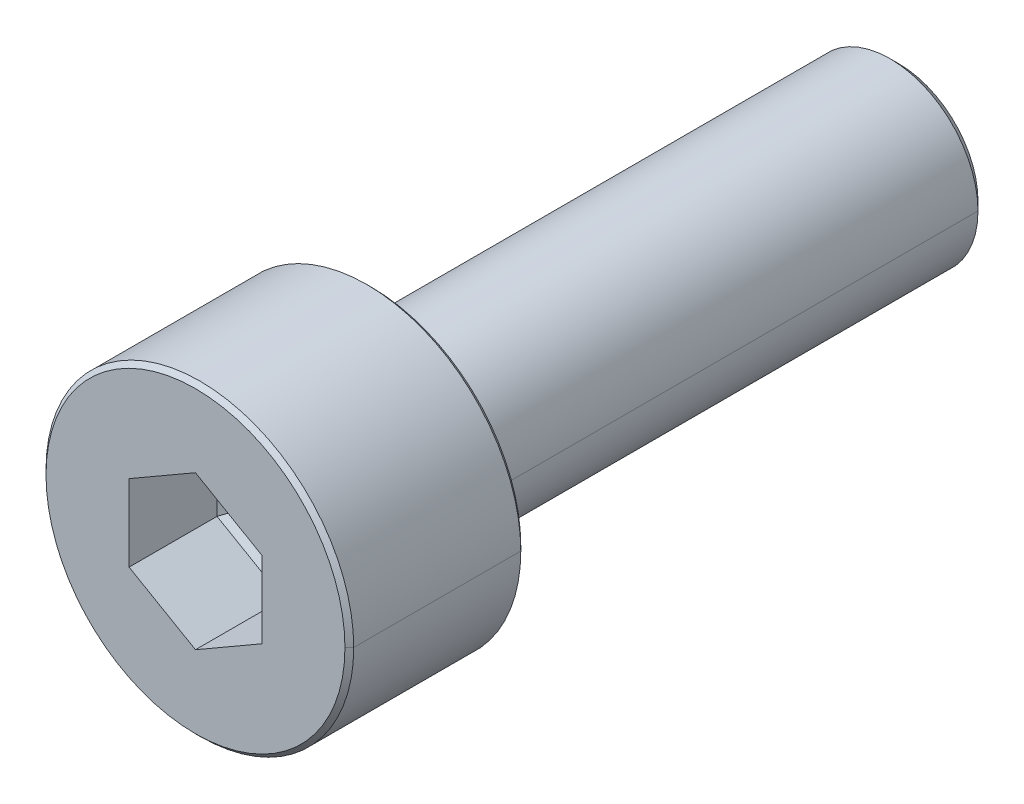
ISO-10303-21;
HEADER;
FILE_DESCRIPTION(('STEP AP214'),'2;1');
FILE_NAME('part.step','',(''),(''),'','','');
FILE_SCHEMA(('AUTOMOTIVE_DESIGN { 1 0 10303 214 1 1 1 1 }'));
ENDSEC;
DATA;
#1=APPLICATION_CONTEXT('core data for automotive mechanical design processes');
#2=APPLICATION_PROTOCOL_DEFINITION('international standard','automotive_design',2000,#1);
#3=PRODUCT_CONTEXT('',#1,'mechanical');
#4=PRODUCT('Part','Part','',(#3));
#5=PRODUCT_RELATED_PRODUCT_CATEGORY('part','',(#4));
#6=PRODUCT_DEFINITION_FORMATION('','',#4);
#7=PRODUCT_DEFINITION_CONTEXT('part definition',#1,'design');
#8=PRODUCT_DEFINITION('design','',#6,#7);
#9=PRODUCT_DEFINITION_SHAPE('','',#8);
#10=(LENGTH_UNIT() NAMED_UNIT(*) SI_UNIT(.MILLI.,.METRE.));
#11=(NAMED_UNIT(*) PLANE_ANGLE_UNIT() SI_UNIT($,.RADIAN.));
#12=(NAMED_UNIT(*) SI_UNIT($,.STERADIAN.) SOLID_ANGLE_UNIT());
#13=UNCERTAINTY_MEASURE_WITH_UNIT(LENGTH_MEASURE(1.E-05),#10,'distance_accuracy_value','');
#14=(GEOMETRIC_REPRESENTATION_CONTEXT(3) GLOBAL_UNCERTAINTY_ASSIGNED_CONTEXT((#13)) GLOBAL_UNIT_ASSIGNED_CONTEXT((#10,
#11,#12)) REPRESENTATION_CONTEXT('',''));
#15=CARTESIAN_POINT('',(0.,0.,0.));
#16=DIRECTION('',(0.,0.,1.));
#17=DIRECTION('',(1.,0.,0.));
#18=AXIS2_PLACEMENT_3D('',#15,#16,#17);
#19=CARTESIAN_POINT('',(0.,0.,12.));
#20=DIRECTION('',(0.,0.,1.));
#21=DIRECTION('',(1.,0.,0.));
#22=AXIS2_PLACEMENT_3D('',#19,#20,#21);
#23=CYLINDRICAL_SURFACE('',#22,3.5);
#24=DIRECTION('',(0.,0.,1.));
#25=VECTOR('',#24,1.);
#26=CARTESIAN_POINT('',(3.500000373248,1.021091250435E-09,12.09999962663));
#27=LINE('',#26,#25);
#28=CARTESIAN_POINT('',(3.5,0.,12.10000099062));
#29=VERTEX_POINT('',#28);
#30=CARTESIAN_POINT('',(3.5,0.,15.89999900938));
#31=VERTEX_POINT('',#30);
#32=EDGE_CURVE('E215',#29,#31,#27,.T.);
#33=ORIENTED_EDGE('',*,*,#32,.F.);
#34=CARTESIAN_POINT('',(0.,0.,12.10000099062));
#35=DIRECTION('',(0.,0.,-1.));
#36=DIRECTION('',(-1.,0.,0.));
#37=AXIS2_PLACEMENT_3D('',#34,#35,#36);
#38=CIRCLE('',#37,3.5);
#39=CARTESIAN_POINT('',(-3.5,0.,12.10000099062));
#40=VERTEX_POINT('',#39);
#41=EDGE_CURVE('E241',#40,#29,#38,.T.);
#42=ORIENTED_EDGE('',*,*,#41,.F.);
#43=DIRECTION('',(0.,0.,1.));
#44=VECTOR('',#43,1.);
#45=CARTESIAN_POINT('',(-3.500000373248,-1.021091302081E-09,12.09999962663));
#46=LINE('',#45,#44);
#47=CARTESIAN_POINT('',(-3.5,0.,15.89999900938));
#48=VERTEX_POINT('',#47);
#49=EDGE_CURVE('E229',#40,#48,#46,.T.);
#50=ORIENTED_EDGE('',*,*,#49,.T.);
#51=CARTESIAN_POINT('',(0.,0.,15.89999900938));
#52=DIRECTION('',(0.,0.,1.));
#53=DIRECTION('',(1.,0.,0.));
#54=AXIS2_PLACEMENT_3D('',#51,#52,#53);
#55=CIRCLE('',#54,3.5);
#56=EDGE_CURVE('E10',#31,#48,#55,.T.);
#57=ORIENTED_EDGE('',*,*,#56,.F.);
#58=EDGE_LOOP('',(#33,#42,#50,#57));
#59=FACE_BOUND('',#58,.T.);
#60=ADVANCED_FACE('F15',(#59),#23,.T.);
#61=CARTESIAN_POINT('',(0.,0.,15.95000061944));
#62=DIRECTION('',(0.,0.,-1.));
#63=DIRECTION('',(0.,-1.,0.));
#64=AXIS2_PLACEMENT_3D('',#61,#62,#63);
#65=CONICAL_SURFACE('',#64,3.450000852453,0.78539837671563);
#66=DIRECTION('',(0.707106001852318,-2.13168504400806E-09,-0.707107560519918));
#67=VECTOR('',#66,1.);
#68=CARTESIAN_POINT('',(3.400000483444,1.322556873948E-09,16.0000004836));
#69=LINE('',#68,#67);
#70=CARTESIAN_POINT('',(3.400000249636,0.,16.00000120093));
#71=VERTEX_POINT('',#70);
#72=EDGE_CURVE('E210',#71,#31,#69,.T.);
#73=ORIENTED_EDGE('',*,*,#72,.T.);
#74=ORIENTED_EDGE('',*,*,#56,.T.);
#75=DIRECTION('',(-0.707106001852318,2.13168543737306E-09,-0.707107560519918));
#76=VECTOR('',#75,1.);
#77=CARTESIAN_POINT('',(-3.400000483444,-1.322555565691E-09,16.0000004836));
#78=LINE('',#77,#76);
#79=CARTESIAN_POINT('',(-3.400000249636,0.,16.00000120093));
#80=VERTEX_POINT('',#79);
#81=EDGE_CURVE('E214',#80,#48,#78,.T.);
#82=ORIENTED_EDGE('',*,*,#81,.F.);
#83=CARTESIAN_POINT('',(0.,0.,16.00000120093));
#84=DIRECTION('',(0.,0.,1.));
#85=DIRECTION('',(1.,0.,0.));
#86=AXIS2_PLACEMENT_3D('',#83,#84,#85);
#87=CIRCLE('',#86,3.400000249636);
#88=EDGE_CURVE('E209',#71,#80,#87,.T.);
#89=ORIENTED_EDGE('',*,*,#88,.F.);
#90=EDGE_LOOP('',(#73,#74,#82,#89));
#91=FACE_BOUND('',#90,.T.);
#92=ADVANCED_FACE('F386',(#91),#65,.T.);
#93=CARTESIAN_POINT('',(0.,0.,13.));
#94=DIRECTION('',(0.,0.,1.));
#95=DIRECTION('',(1.,0.,0.));
#96=AXIS2_PLACEMENT_3D('',#93,#94,#95);
#97=PLANE('',#96);
#98=DIRECTION('',(-0.866025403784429,0.500000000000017,0.));
#99=VECTOR('',#98,1.);
#100=CARTESIAN_POINT('',(0.08660254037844,0.05,13.));
#101=LINE('',#100,#99);
#102=CARTESIAN_POINT('',(0.08660254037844,0.05,13.));
#103=VERTEX_POINT('',#102);
#104=CARTESIAN_POINT('',(0.,0.1,13.));
#105=VERTEX_POINT('',#104);
#106=EDGE_CURVE('E285',#103,#105,#101,.T.);
#107=ORIENTED_EDGE('',*,*,#106,.T.);
#108=DIRECTION('',(-0.866025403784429,-0.500000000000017,0.));
#109=VECTOR('',#108,1.);
#110=CARTESIAN_POINT('',(0.,0.1,13.));
#111=LINE('',#110,#109);
#112=CARTESIAN_POINT('',(-0.08660254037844,0.05,13.));
#113=VERTEX_POINT('',#112);
#114=EDGE_CURVE('E266',#105,#113,#111,.T.);
#115=ORIENTED_EDGE('',*,*,#114,.T.);
#116=DIRECTION('',(0.,-1.,0.));
#117=VECTOR('',#116,1.);
#118=CARTESIAN_POINT('',(-0.08660254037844,0.05,13.));
#119=LINE('',#118,#117);
#120=CARTESIAN_POINT('',(-0.08660254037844,-0.05,13.));
#121=VERTEX_POINT('',#120);
#122=EDGE_CURVE('E40',#113,#121,#119,.T.);
#123=ORIENTED_EDGE('',*,*,#122,.T.);
#124=DIRECTION('',(0.866025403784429,-0.500000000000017,0.));
#125=VECTOR('',#124,1.);
#126=CARTESIAN_POINT('',(-0.08660254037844,-0.05,13.));
#127=LINE('',#126,#125);
#128=CARTESIAN_POINT('',(0.,-0.1,13.));
#129=VERTEX_POINT('',#128);
#130=EDGE_CURVE('E217',#121,#129,#127,.T.);
#131=ORIENTED_EDGE('',*,*,#130,.T.);
#132=DIRECTION('',(0.866025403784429,0.500000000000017,0.));
#133=VECTOR('',#132,1.);
#134=CARTESIAN_POINT('',(0.,-0.1,13.));
#135=LINE('',#134,#133);
#136=CARTESIAN_POINT('',(0.08660254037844,-0.05,13.));
#137=VERTEX_POINT('',#136);
#138=EDGE_CURVE('E204',#129,#137,#135,.T.);
#139=ORIENTED_EDGE('',*,*,#138,.T.);
#140=DIRECTION('',(0.,1.,0.));
#141=VECTOR('',#140,1.);
#142=CARTESIAN_POINT('',(0.08660254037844,-0.05,13.));
#143=LINE('',#142,#141);
#144=EDGE_CURVE('E253',#137,#103,#143,.T.);
#145=ORIENTED_EDGE('',*,*,#144,.T.);
#146=EDGE_LOOP('',(#107,#115,#123,#131,#139,#145));
#147=FACE_BOUND('',#146,.T.);
#148=ADVANCED_FACE('F433',(#147),#97,.T.);
#149=CARTESIAN_POINT('',(-1.51,0.8717989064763,16.));
#150=DIRECTION('',(-1.,0.,0.));
#151=DIRECTION('',(0.,0.,1.));
#152=AXIS2_PLACEMENT_3D('',#149,#150,#151);
#153=PLANE('',#152);
#154=DIRECTION('',(0.,0.,-1.));
#155=VECTOR('',#154,1.);
#156=CARTESIAN_POINT('',(-1.51,0.8717989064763,16.));
#157=LINE('',#156,#155);
#158=CARTESIAN_POINT('',(-1.51,0.8717989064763,16.));
#159=VERTEX_POINT('',#158);
#160=CARTESIAN_POINT('',(-1.51,0.8717989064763,14.));
#161=VERTEX_POINT('',#160);
#162=EDGE_CURVE('E193',#159,#161,#157,.T.);
#163=ORIENTED_EDGE('',*,*,#162,.F.);
#164=DIRECTION('',(0.,-1.,0.));
#165=VECTOR('',#164,1.);
#166=CARTESIAN_POINT('',(-1.51,0.8717989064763,16.));
#167=LINE('',#166,#165);
#168=CARTESIAN_POINT('',(-1.51,-0.8717989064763,16.));
#169=VERTEX_POINT('',#168);
#170=EDGE_CURVE('E228',#159,#169,#167,.T.);
#171=ORIENTED_EDGE('',*,*,#170,.T.);
#172=DIRECTION('',(0.,0.,-1.));
#173=VECTOR('',#172,1.);
#174=CARTESIAN_POINT('',(-1.51,-0.8717989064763,16.));
#175=LINE('',#174,#173);
#176=CARTESIAN_POINT('',(-1.51,-0.8717989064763,14.));
#177=VERTEX_POINT('',#176);
#178=EDGE_CURVE('E300',#169,#177,#175,.T.);
#179=ORIENTED_EDGE('',*,*,#178,.T.);
#180=DIRECTION('',(0.,-1.,0.));
#181=VECTOR('',#180,1.);
#182=CARTESIAN_POINT('',(-1.51,0.8717989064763,14.));
#183=LINE('',#182,#181);
#184=EDGE_CURVE('E26',#161,#177,#183,.T.);
#185=ORIENTED_EDGE('',*,*,#184,.F.);
#186=EDGE_LOOP('',(#163,#171,#179,#185));
#187=FACE_BOUND('',#186,.T.);
#188=ADVANCED_FACE('F350',(#187),#153,.F.);
#189=CARTESIAN_POINT('',(-0.7983012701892,0.,13.5));
#190=DIRECTION('',(-0.574858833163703,0.,-0.818252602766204));
#191=DIRECTION('',(-0.818252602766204,0.,0.574858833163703));
#192=AXIS2_PLACEMENT_3D('',#189,#190,#191);
#193=PLANE('',#192);
#194=DIRECTION('',(-0.73984776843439,-0.427151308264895,0.519775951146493));
#195=VECTOR('',#194,1.);
#196=CARTESIAN_POINT('',(-0.08660254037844,-0.05,13.));
#197=LINE('',#196,#195);
#198=EDGE_CURVE('E220',#121,#177,#197,.T.);
#199=ORIENTED_EDGE('',*,*,#198,.F.);
#200=ORIENTED_EDGE('',*,*,#122,.F.);
#201=DIRECTION('',(-0.73984776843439,0.427151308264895,0.519775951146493));
#202=VECTOR('',#201,1.);
#203=CARTESIAN_POINT('',(-0.08660254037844,0.05,13.));
#204=LINE('',#203,#202);
#205=EDGE_CURVE('E262',#113,#161,#204,.T.);
#206=ORIENTED_EDGE('',*,*,#205,.T.);
#207=ORIENTED_EDGE('',*,*,#184,.T.);
#208=EDGE_LOOP('',(#199,#200,#206,#207));
#209=FACE_BOUND('',#208,.T.);
#210=ADVANCED_FACE('F17',(#209),#193,.F.);
#211=CARTESIAN_POINT('',(-0.3991506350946,-0.6913491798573,13.5));
#212=DIRECTION('',(-0.287429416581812,-0.49784235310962,-0.818252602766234));
#213=DIRECTION('',(0.,-0.854302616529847,0.519775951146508));
#214=AXIS2_PLACEMENT_3D('',#211,#212,#213);
#215=PLANE('',#214);
#216=DIRECTION('',(0.,-0.854302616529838,0.519775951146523));
#217=VECTOR('',#216,1.);
#218=CARTESIAN_POINT('',(0.,-0.1,13.));
#219=LINE('',#218,#217);
#220=CARTESIAN_POINT('',(0.,-1.743597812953,14.));
#221=VERTEX_POINT('',#220);
#222=EDGE_CURVE('E199',#129,#221,#219,.T.);
#223=ORIENTED_EDGE('',*,*,#222,.F.);
#224=ORIENTED_EDGE('',*,*,#130,.F.);
#225=ORIENTED_EDGE('',*,*,#198,.T.);
#226=DIRECTION('',(0.866025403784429,-0.500000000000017,0.));
#227=VECTOR('',#226,1.);
#228=CARTESIAN_POINT('',(-1.51,-0.8717989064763,14.));
#229=LINE('',#228,#227);
#230=EDGE_CURVE('E221',#177,#221,#229,.T.);
#231=ORIENTED_EDGE('',*,*,#230,.T.);
#232=EDGE_LOOP('',(#223,#224,#225,#231));
#233=FACE_BOUND('',#232,.T.);
#234=ADVANCED_FACE('F501',(#233),#215,.F.);
#235=CARTESIAN_POINT('',(-1.51,-0.8717989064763,16.));
#236=DIRECTION('',(-0.500000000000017,-0.866025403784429,0.));
#237=DIRECTION('',(-0.866025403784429,0.500000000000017,0.));
#238=AXIS2_PLACEMENT_3D('',#235,#236,#237);
#239=PLANE('',#238);
#240=ORIENTED_EDGE('',*,*,#178,.F.);
#241=DIRECTION('',(0.866025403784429,-0.500000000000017,0.));
#242=VECTOR('',#241,1.);
#243=CARTESIAN_POINT('',(-1.51,-0.8717989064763,16.));
#244=LINE('',#243,#242);
#245=CARTESIAN_POINT('',(0.,-1.743597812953,16.));
#246=VERTEX_POINT('',#245);
#247=EDGE_CURVE('E191',#169,#246,#244,.T.);
#248=ORIENTED_EDGE('',*,*,#247,.T.);
#249=DIRECTION('',(0.,0.,-1.));
#250=VECTOR('',#249,1.);
#251=CARTESIAN_POINT('',(0.,-1.743597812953,16.));
#252=LINE('',#251,#250);
#253=EDGE_CURVE('E301',#246,#221,#252,.T.);
#254=ORIENTED_EDGE('',*,*,#253,.T.);
#255=ORIENTED_EDGE('',*,*,#230,.F.);
#256=EDGE_LOOP('',(#240,#248,#254,#255));
#257=FACE_BOUND('',#256,.T.);
#258=ADVANCED_FACE('F360',(#257),#239,.F.);
#259=CARTESIAN_POINT('',(0.,-1.743597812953,16.));
#260=DIRECTION('',(0.500000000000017,-0.866025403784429,0.));
#261=DIRECTION('',(0.,0.,-1.));
#262=AXIS2_PLACEMENT_3D('',#259,#260,#261);
#263=PLANE('',#262);
#264=ORIENTED_EDGE('',*,*,#253,.F.);
#265=DIRECTION('',(0.866025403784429,0.500000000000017,0.));
#266=VECTOR('',#265,1.);
#267=CARTESIAN_POINT('',(0.,-1.743597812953,16.));
#268=LINE('',#267,#266);
#269=CARTESIAN_POINT('',(1.51,-0.8717989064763,16.));
#270=VERTEX_POINT('',#269);
#271=EDGE_CURVE('E188',#246,#270,#268,.T.);
#272=ORIENTED_EDGE('',*,*,#271,.T.);
#273=DIRECTION('',(0.,0.,-1.));
#274=VECTOR('',#273,1.);
#275=CARTESIAN_POINT('',(1.51,-0.8717989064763,16.));
#276=LINE('',#275,#274);
#277=CARTESIAN_POINT('',(1.51,-0.8717989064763,14.));
#278=VERTEX_POINT('',#277);
#279=EDGE_CURVE('E247',#270,#278,#276,.T.);
#280=ORIENTED_EDGE('',*,*,#279,.T.);
#281=DIRECTION('',(0.866025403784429,0.500000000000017,0.));
#282=VECTOR('',#281,1.);
#283=CARTESIAN_POINT('',(0.,-1.743597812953,14.));
#284=LINE('',#283,#282);
#285=EDGE_CURVE('E203',#221,#278,#284,.T.);
#286=ORIENTED_EDGE('',*,*,#285,.F.);
#287=EDGE_LOOP('',(#264,#272,#280,#286));
#288=FACE_BOUND('',#287,.T.);
#289=ADVANCED_FACE('F439',(#288),#263,.F.);
#290=CARTESIAN_POINT('',(0.3991506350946,-0.6913491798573,13.5));
#291=DIRECTION('',(0.287429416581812,-0.49784235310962,-0.818252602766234));
#292=DIRECTION('',(0.,-0.854302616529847,0.519775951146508));
#293=AXIS2_PLACEMENT_3D('',#290,#291,#292);
#294=PLANE('',#293);
#295=DIRECTION('',(0.73984776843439,-0.427151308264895,0.519775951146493));
#296=VECTOR('',#295,1.);
#297=CARTESIAN_POINT('',(0.08660254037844,-0.05,13.));
#298=LINE('',#297,#296);
#299=EDGE_CURVE('E236',#137,#278,#298,.T.);
#300=ORIENTED_EDGE('',*,*,#299,.F.);
#301=ORIENTED_EDGE('',*,*,#138,.F.);
#302=ORIENTED_EDGE('',*,*,#222,.T.);
#303=ORIENTED_EDGE('',*,*,#285,.T.);
#304=EDGE_LOOP('',(#300,#301,#302,#303));
#305=FACE_BOUND('',#304,.T.);
#306=ADVANCED_FACE('F442',(#305),#294,.F.);
#307=CARTESIAN_POINT('',(0.7983012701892,0.,13.5));
#308=DIRECTION('',(0.574858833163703,0.,-0.818252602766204));
#309=DIRECTION('',(0.,-1.,0.));
#310=AXIS2_PLACEMENT_3D('',#307,#308,#309);
#311=PLANE('',#310);
#312=DIRECTION('',(0.73984776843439,0.427151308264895,0.519775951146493));
#313=VECTOR('',#312,1.);
#314=CARTESIAN_POINT('',(0.08660254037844,0.05,13.));
#315=LINE('',#314,#313);
#316=CARTESIAN_POINT('',(1.51,0.8717989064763,14.));
#317=VERTEX_POINT('',#316);
#318=EDGE_CURVE('E295',#103,#317,#315,.T.);
#319=ORIENTED_EDGE('',*,*,#318,.F.);
#320=ORIENTED_EDGE('',*,*,#144,.F.);
#321=ORIENTED_EDGE('',*,*,#299,.T.);
#322=DIRECTION('',(0.,1.,0.));
#323=VECTOR('',#322,1.);
#324=CARTESIAN_POINT('',(1.51,-0.8717989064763,14.));
#325=LINE('',#324,#323);
#326=EDGE_CURVE('E256',#278,#317,#325,.T.);
#327=ORIENTED_EDGE('',*,*,#326,.T.);
#328=EDGE_LOOP('',(#319,#320,#321,#327));
#329=FACE_BOUND('',#328,.T.);
#330=ADVANCED_FACE('F447',(#329),#311,.F.);
#331=CARTESIAN_POINT('',(1.51,-0.8717989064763,16.));
#332=DIRECTION('',(1.,0.,0.));
#333=DIRECTION('',(0.,1.,0.));
#334=AXIS2_PLACEMENT_3D('',#331,#332,#333);
#335=PLANE('',#334);
#336=ORIENTED_EDGE('',*,*,#279,.F.);
#337=DIRECTION('',(0.,1.,0.));
#338=VECTOR('',#337,1.);
#339=CARTESIAN_POINT('',(1.51,-0.8717989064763,16.));
#340=LINE('',#339,#338);
#341=CARTESIAN_POINT('',(1.51,0.8717989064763,16.));
#342=VERTEX_POINT('',#341);
#343=EDGE_CURVE('E192',#270,#342,#340,.T.);
#344=ORIENTED_EDGE('',*,*,#343,.T.);
#345=DIRECTION('',(0.,0.,-1.));
#346=VECTOR('',#345,1.);
#347=CARTESIAN_POINT('',(1.51,0.8717989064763,16.));
#348=LINE('',#347,#346);
#349=EDGE_CURVE('E244',#342,#317,#348,.T.);
#350=ORIENTED_EDGE('',*,*,#349,.T.);
#351=ORIENTED_EDGE('',*,*,#326,.F.);
#352=EDGE_LOOP('',(#336,#344,#350,#351));
#353=FACE_BOUND('',#352,.T.);
#354=ADVANCED_FACE('F452',(#353),#335,.F.);
#355=CARTESIAN_POINT('',(1.51,0.8717989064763,16.));
#356=DIRECTION('',(0.500000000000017,0.866025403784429,0.));
#357=DIRECTION('',(0.,0.,-1.));
#358=AXIS2_PLACEMENT_3D('',#355,#356,#357);
#359=PLANE('',#358);
#360=ORIENTED_EDGE('',*,*,#349,.F.);
#361=DIRECTION('',(-0.866025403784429,0.500000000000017,0.));
#362=VECTOR('',#361,1.);
#363=CARTESIAN_POINT('',(1.51,0.8717989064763,16.));
#364=LINE('',#363,#362);
#365=CARTESIAN_POINT('',(0.,1.743597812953,16.));
#366=VERTEX_POINT('',#365);
#367=EDGE_CURVE('E270',#342,#366,#364,.T.);
#368=ORIENTED_EDGE('',*,*,#367,.T.);
#369=DIRECTION('',(0.,0.,-1.));
#370=VECTOR('',#369,1.);
#371=CARTESIAN_POINT('',(0.,1.743597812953,16.));
#372=LINE('',#371,#370);
#373=CARTESIAN_POINT('',(0.,1.743597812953,14.));
#374=VERTEX_POINT('',#373);
#375=EDGE_CURVE('E198',#366,#374,#372,.T.);
#376=ORIENTED_EDGE('',*,*,#375,.T.);
#377=DIRECTION('',(-0.866025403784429,0.500000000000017,0.));
#378=VECTOR('',#377,1.);
#379=CARTESIAN_POINT('',(1.51,0.8717989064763,14.));
#380=LINE('',#379,#378);
#381=EDGE_CURVE('E248',#317,#374,#380,.T.);
#382=ORIENTED_EDGE('',*,*,#381,.F.);
#383=EDGE_LOOP('',(#360,#368,#376,#382));
#384=FACE_BOUND('',#383,.T.);
#385=ADVANCED_FACE('F448',(#384),#359,.F.);
#386=CARTESIAN_POINT('',(0.3991506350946,0.6913491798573,13.5));
#387=DIRECTION('',(0.287429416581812,0.49784235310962,-0.818252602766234));
#388=DIRECTION('',(-0.943483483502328,0.,-0.331419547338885));
#389=AXIS2_PLACEMENT_3D('',#386,#387,#388);
#390=PLANE('',#389);
#391=DIRECTION('',(0.,0.854302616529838,0.519775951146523));
#392=VECTOR('',#391,1.);
#393=CARTESIAN_POINT('',(0.,0.1,13.));
#394=LINE('',#393,#392);
#395=EDGE_CURVE('E281',#105,#374,#394,.T.);
#396=ORIENTED_EDGE('',*,*,#395,.F.);
#397=ORIENTED_EDGE('',*,*,#106,.F.);
#398=ORIENTED_EDGE('',*,*,#318,.T.);
#399=ORIENTED_EDGE('',*,*,#381,.T.);
#400=EDGE_LOOP('',(#396,#397,#398,#399));
#401=FACE_BOUND('',#400,.T.);
#402=ADVANCED_FACE('F451',(#401),#390,.F.);
#403=CARTESIAN_POINT('',(-0.3991506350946,0.6913491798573,13.5));
#404=DIRECTION('',(-0.287429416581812,0.49784235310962,-0.818252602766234));
#405=DIRECTION('',(-0.943483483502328,0.,0.331419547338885));
#406=AXIS2_PLACEMENT_3D('',#403,#404,#405);
#407=PLANE('',#406);
#408=ORIENTED_EDGE('',*,*,#205,.F.);
#409=ORIENTED_EDGE('',*,*,#114,.F.);
#410=ORIENTED_EDGE('',*,*,#395,.T.);
#411=DIRECTION('',(-0.866025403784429,-0.500000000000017,0.));
#412=VECTOR('',#411,1.);
#413=CARTESIAN_POINT('',(0.,1.743597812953,14.));
#414=LINE('',#413,#412);
#415=EDGE_CURVE('E197',#374,#161,#414,.T.);
#416=ORIENTED_EDGE('',*,*,#415,.T.);
#417=EDGE_LOOP('',(#408,#409,#410,#416));
#418=FACE_BOUND('',#417,.T.);
#419=ADVANCED_FACE('F456',(#418),#407,.F.);
#420=CARTESIAN_POINT('',(0.,1.743597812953,16.));
#421=DIRECTION('',(-0.500000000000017,0.866025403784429,0.));
#422=DIRECTION('',(0.,0.,1.));
#423=AXIS2_PLACEMENT_3D('',#420,#421,#422);
#424=PLANE('',#423);
#425=ORIENTED_EDGE('',*,*,#375,.F.);
#426=DIRECTION('',(-0.866025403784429,-0.500000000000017,0.));
#427=VECTOR('',#426,1.);
#428=CARTESIAN_POINT('',(0.,1.743597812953,16.));
#429=LINE('',#428,#427);
#430=EDGE_CURVE('E277',#366,#159,#429,.T.);
#431=ORIENTED_EDGE('',*,*,#430,.T.);
#432=ORIENTED_EDGE('',*,*,#162,.T.);
#433=ORIENTED_EDGE('',*,*,#415,.F.);
#434=EDGE_LOOP('',(#425,#431,#432,#433));
#435=FACE_BOUND('',#434,.T.);
#436=ADVANCED_FACE('F437',(#435),#424,.F.);
#437=CARTESIAN_POINT('',(0.,0.,16.));
#438=DIRECTION('',(0.,0.,1.));
#439=DIRECTION('',(1.,0.,0.));
#440=AXIS2_PLACEMENT_3D('',#437,#438,#439);
#441=PLANE('',#440);
#442=ORIENTED_EDGE('',*,*,#367,.F.);
#443=ORIENTED_EDGE('',*,*,#343,.F.);
#444=ORIENTED_EDGE('',*,*,#271,.F.);
#445=ORIENTED_EDGE('',*,*,#247,.F.);
#446=ORIENTED_EDGE('',*,*,#170,.F.);
#447=ORIENTED_EDGE('',*,*,#430,.F.);
#448=EDGE_LOOP('',(#442,#443,#444,#445,#446,#447));
#449=FACE_BOUND('',#448,.T.);
#450=CARTESIAN_POINT('',(0.,0.,16.00000120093));
#451=DIRECTION('',(0.,0.,1.));
#452=DIRECTION('',(-1.,0.,0.));
#453=AXIS2_PLACEMENT_3D('',#450,#451,#452);
#454=CIRCLE('',#453,3.400000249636);
#455=EDGE_CURVE('E205',#80,#71,#454,.T.);
#456=ORIENTED_EDGE('',*,*,#455,.T.);
#457=ORIENTED_EDGE('',*,*,#88,.T.);
#458=EDGE_LOOP('',(#456,#457));
#459=FACE_BOUND('',#458,.T.);
#460=ADVANCED_FACE('F357',(#449,#459),#441,.T.);
#461=CARTESIAN_POINT('',(0.,0.,15.95000061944));
#462=DIRECTION('',(0.,0.,-1.));
#463=DIRECTION('',(0.,-1.,0.));
#464=AXIS2_PLACEMENT_3D('',#461,#462,#463);
#465=CONICAL_SURFACE('',#464,3.450000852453,0.78539837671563);
#466=ORIENTED_EDGE('',*,*,#81,.T.);
#467=CARTESIAN_POINT('',(0.,0.,15.89999900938));
#468=DIRECTION('',(0.,0.,1.));
#469=DIRECTION('',(-1.,0.,0.));
#470=AXIS2_PLACEMENT_3D('',#467,#468,#469);
#471=CIRCLE('',#470,3.5);
#472=EDGE_CURVE('E211',#48,#31,#471,.T.);
#473=ORIENTED_EDGE('',*,*,#472,.T.);
#474=ORIENTED_EDGE('',*,*,#72,.F.);
#475=ORIENTED_EDGE('',*,*,#455,.F.);
#476=EDGE_LOOP('',(#466,#473,#474,#475));
#477=FACE_BOUND('',#476,.T.);
#478=ADVANCED_FACE('F384',(#477),#465,.T.);
#479=CARTESIAN_POINT('',(0.,0.,12.));
#480=DIRECTION('',(0.,0.,1.));
#481=DIRECTION('',(1.,0.,0.));
#482=AXIS2_PLACEMENT_3D('',#479,#480,#481);
#483=CYLINDRICAL_SURFACE('',#482,3.5);
#484=ORIENTED_EDGE('',*,*,#49,.F.);
#485=CARTESIAN_POINT('',(0.,0.,12.10000099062));
#486=DIRECTION('',(0.,0.,-1.));
#487=DIRECTION('',(1.,0.,0.));
#488=AXIS2_PLACEMENT_3D('',#485,#486,#487);
#489=CIRCLE('',#488,3.5);
#490=EDGE_CURVE('E233',#29,#40,#489,.T.);
#491=ORIENTED_EDGE('',*,*,#490,.F.);
#492=ORIENTED_EDGE('',*,*,#32,.T.);
#493=ORIENTED_EDGE('',*,*,#472,.F.);
#494=EDGE_LOOP('',(#484,#491,#492,#493));
#495=FACE_BOUND('',#494,.T.);
#496=ADVANCED_FACE('F394',(#495),#483,.T.);
#497=CARTESIAN_POINT('',(0.,0.,12.04999938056));
#498=DIRECTION('',(0.,0.,1.));
#499=DIRECTION('',(0.,-1.,0.));
#500=AXIS2_PLACEMENT_3D('',#497,#498,#499);
#501=CONICAL_SURFACE('',#500,3.450000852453,0.78539837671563);
#502=DIRECTION('',(0.707106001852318,-2.13168805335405E-09,0.707107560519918));
#503=VECTOR('',#502,1.);
#504=CARTESIAN_POINT('',(3.400000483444,1.322557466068E-09,11.9999995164));
#505=LINE('',#504,#503);
#506=CARTESIAN_POINT('',(3.400000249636,0.,11.99999879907));
#507=VERTEX_POINT('',#506);
#508=EDGE_CURVE('E237',#507,#29,#505,.T.);
#509=ORIENTED_EDGE('',*,*,#508,.T.);
#510=ORIENTED_EDGE('',*,*,#490,.T.);
#511=DIRECTION('',(-0.707106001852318,2.13168074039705E-09,0.707107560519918));
#512=VECTOR('',#511,1.);
#513=CARTESIAN_POINT('',(-3.400000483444,-1.322556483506E-09,11.9999995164));
#514=LINE('',#513,#512);
#515=CARTESIAN_POINT('',(-3.400000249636,0.,11.99999879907));
#516=VERTEX_POINT('',#515);
#517=EDGE_CURVE('E19',#516,#40,#514,.T.);
#518=ORIENTED_EDGE('',*,*,#517,.F.);
#519=CARTESIAN_POINT('',(0.,0.,11.99999879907));
#520=DIRECTION('',(0.,0.,-1.));
#521=DIRECTION('',(1.,0.,0.));
#522=AXIS2_PLACEMENT_3D('',#519,#520,#521);
#523=CIRCLE('',#522,3.400000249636);
#524=EDGE_CURVE('E261',#507,#516,#523,.T.);
#525=ORIENTED_EDGE('',*,*,#524,.F.);
#526=EDGE_LOOP('',(#509,#510,#518,#525));
#527=FACE_BOUND('',#526,.T.);
#528=ADVANCED_FACE('F396',(#527),#501,.T.);
#529=CARTESIAN_POINT('',(0.,0.,12.04999938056));
#530=DIRECTION('',(0.,0.,1.));
#531=DIRECTION('',(0.,-1.,0.));
#532=AXIS2_PLACEMENT_3D('',#529,#530,#531);
#533=CONICAL_SURFACE('',#532,3.450000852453,0.78539837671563);
#534=ORIENTED_EDGE('',*,*,#517,.T.);
#535=ORIENTED_EDGE('',*,*,#41,.T.);
#536=ORIENTED_EDGE('',*,*,#508,.F.);
#537=CARTESIAN_POINT('',(0.,0.,11.99999879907));
#538=DIRECTION('',(0.,0.,-1.));
#539=DIRECTION('',(-1.,0.,0.));
#540=AXIS2_PLACEMENT_3D('',#537,#538,#539);
#541=CIRCLE('',#540,3.400000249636);
#542=EDGE_CURVE('E292',#516,#507,#541,.T.);
#543=ORIENTED_EDGE('',*,*,#542,.F.);
#544=EDGE_LOOP('',(#534,#535,#536,#543));
#545=FACE_BOUND('',#544,.T.);
#546=ADVANCED_FACE('F484',(#545),#533,.T.);
#547=CARTESIAN_POINT('',(0.,0.,12.));
#548=DIRECTION('',(0.,0.,1.));
#549=DIRECTION('',(1.,0.,0.));
#550=AXIS2_PLACEMENT_3D('',#547,#548,#549);
#551=PLANE('',#550);
#552=CARTESIAN_POINT('',(0.,0.,12.));
#553=DIRECTION('',(0.,0.,1.));
#554=DIRECTION('',(-1.,0.,0.));
#555=AXIS2_PLACEMENT_3D('',#552,#553,#554);
#556=CIRCLE('',#555,2.);
#557=CARTESIAN_POINT('',(-2.,0.,12.));
#558=VERTEX_POINT('',#557);
#559=CARTESIAN_POINT('',(2.,0.,12.));
#560=VERTEX_POINT('',#559);
#561=EDGE_CURVE('E154',#558,#560,#556,.T.);
#562=ORIENTED_EDGE('',*,*,#561,.T.);
#563=CARTESIAN_POINT('',(0.,0.,12.));
#564=DIRECTION('',(0.,0.,1.));
#565=DIRECTION('',(1.,0.,0.));
#566=AXIS2_PLACEMENT_3D('',#563,#564,#565);
#567=CIRCLE('',#566,2.);
#568=EDGE_CURVE('E149',#560,#558,#567,.T.);
#569=ORIENTED_EDGE('',*,*,#568,.T.);
#570=EDGE_LOOP('',(#562,#569));
#571=FACE_BOUND('',#570,.T.);
#572=ORIENTED_EDGE('',*,*,#524,.T.);
#573=ORIENTED_EDGE('',*,*,#542,.T.);
#574=EDGE_LOOP('',(#572,#573));
#575=FACE_BOUND('',#574,.T.);
#576=ADVANCED_FACE('F486',(#571,#575),#551,.F.);
#577=CARTESIAN_POINT('',(0.,0.,0.));
#578=DIRECTION('',(0.,0.,1.));
#579=DIRECTION('',(1.,0.,0.));
#580=AXIS2_PLACEMENT_3D('',#577,#578,#579);
#581=CYLINDRICAL_SURFACE('',#580,2.);
#582=DIRECTION('',(-1.16277488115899E-07,3.97163869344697E-11,1.));
#583=VECTOR('',#582,1.);
#584=CARTESIAN_POINT('',(-1.999998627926,-4.686530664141E-10,0.2000013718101));
#585=LINE('',#584,#583);
#586=CARTESIAN_POINT('',(-2.,0.,0.2000012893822));
#587=VERTEX_POINT('',#586);
#588=EDGE_CURVE('E160',#587,#558,#585,.T.);
#589=ORIENTED_EDGE('',*,*,#588,.T.);
#590=ORIENTED_EDGE('',*,*,#568,.F.);
#591=DIRECTION('',(1.16277488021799E-07,-3.97164005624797E-11,1.));
#592=VECTOR('',#591,1.);
#593=CARTESIAN_POINT('',(1.999998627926,4.686532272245E-10,0.2000013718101));
#594=LINE('',#593,#592);
#595=CARTESIAN_POINT('',(2.,0.,0.2000012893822));
#596=VERTEX_POINT('',#595);
#597=EDGE_CURVE('E142',#596,#560,#594,.T.);
#598=ORIENTED_EDGE('',*,*,#597,.F.);
#599=CARTESIAN_POINT('',(0.,0.,0.2000012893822));
#600=DIRECTION('',(0.,0.,-1.));
#601=DIRECTION('',(-1.,0.,0.));
#602=AXIS2_PLACEMENT_3D('',#599,#600,#601);
#603=CIRCLE('',#602,2.);
#604=EDGE_CURVE('E147',#587,#596,#603,.T.);
#605=ORIENTED_EDGE('',*,*,#604,.F.);
#606=EDGE_LOOP('',(#589,#590,#598,#605));
#607=FACE_BOUND('',#606,.T.);
#608=ADVANCED_FACE('F145',(#607),#581,.T.);
#609=CARTESIAN_POINT('',(0.,0.,0.));
#610=DIRECTION('',(0.,0.,1.));
#611=DIRECTION('',(1.,0.,0.));
#612=AXIS2_PLACEMENT_3D('',#609,#610,#611);
#613=CYLINDRICAL_SURFACE('',#612,2.);
#614=ORIENTED_EDGE('',*,*,#597,.T.);
#615=ORIENTED_EDGE('',*,*,#561,.F.);
#616=ORIENTED_EDGE('',*,*,#588,.F.);
#617=CARTESIAN_POINT('',(0.,0.,0.2000012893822));
#618=DIRECTION('',(0.,0.,-1.));
#619=DIRECTION('',(1.,0.,0.));
#620=AXIS2_PLACEMENT_3D('',#617,#618,#619);
#621=CIRCLE('',#620,2.);
#622=EDGE_CURVE('E155',#596,#587,#621,.T.);
#623=ORIENTED_EDGE('',*,*,#622,.F.);
#624=EDGE_LOOP('',(#614,#615,#616,#623));
#625=FACE_BOUND('',#624,.T.);
#626=ADVANCED_FACE('F159',(#625),#613,.T.);
#627=CARTESIAN_POINT('',(0.,0.,0.1000029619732));
#628=DIRECTION('',(0.,0.,1.));
#629=DIRECTION('',(0.,-1.,0.));
#630=AXIS2_PLACEMENT_3D('',#627,#628,#629);
#631=CONICAL_SURFACE('',#630,1.899997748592,0.785396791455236);
#632=DIRECTION('',(0.707107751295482,-3.31389334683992E-10,0.707105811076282));
#633=VECTOR('',#632,1.);
#634=CARTESIAN_POINT('',(1.799998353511,5.623842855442E-10,1.646172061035E-06));
#635=LINE('',#634,#633);
#636=CARTESIAN_POINT('',(1.799996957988,0.,1.896977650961E-06));
#637=VERTEX_POINT('',#636);
#638=EDGE_CURVE('E163',#637,#596,#635,.T.);
#639=ORIENTED_EDGE('',*,*,#638,.T.);
#640=ORIENTED_EDGE('',*,*,#622,.T.);
#641=DIRECTION('',(-0.707107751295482,3.31387811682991E-10,0.707105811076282));
#642=VECTOR('',#641,1.);
#643=CARTESIAN_POINT('',(-1.799998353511,-5.62383693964E-10,1.646172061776E-06));
#644=LINE('',#643,#642);
#645=CARTESIAN_POINT('',(-1.799996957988,0.,1.896977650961E-06));
#646=VERTEX_POINT('',#645);
#647=EDGE_CURVE('E176',#646,#587,#644,.T.);
#648=ORIENTED_EDGE('',*,*,#647,.F.);
#649=CARTESIAN_POINT('',(0.,0.,1.896977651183E-06));
#650=DIRECTION('',(0.,0.,-1.));
#651=DIRECTION('',(1.,0.,0.));
#652=AXIS2_PLACEMENT_3D('',#649,#650,#651);
#653=CIRCLE('',#652,1.799996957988);
#654=EDGE_CURVE('E169',#637,#646,#653,.T.);
#655=ORIENTED_EDGE('',*,*,#654,.F.);
#656=EDGE_LOOP('',(#639,#640,#648,#655));
#657=FACE_BOUND('',#656,.T.);
#658=ADVANCED_FACE('F167',(#657),#631,.T.);
#659=CARTESIAN_POINT('',(0.,0.,0.1000029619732));
#660=DIRECTION('',(0.,0.,1.));
#661=DIRECTION('',(0.,-1.,0.));
#662=AXIS2_PLACEMENT_3D('',#659,#660,#661);
#663=CONICAL_SURFACE('',#662,1.899997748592,0.785396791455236);
#664=ORIENTED_EDGE('',*,*,#647,.T.);
#665=ORIENTED_EDGE('',*,*,#604,.T.);
#666=ORIENTED_EDGE('',*,*,#638,.F.);
#667=CARTESIAN_POINT('',(0.,0.,1.896977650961E-06));
#668=DIRECTION('',(0.,0.,-1.));
#669=DIRECTION('',(-1.,0.,0.));
#670=AXIS2_PLACEMENT_3D('',#667,#668,#669);
#671=CIRCLE('',#670,1.799996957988);
#672=EDGE_CURVE('E183',#646,#637,#671,.T.);
#673=ORIENTED_EDGE('',*,*,#672,.F.);
#674=EDGE_LOOP('',(#664,#665,#666,#673));
#675=FACE_BOUND('',#674,.T.);
#676=ADVANCED_FACE('F175',(#675),#663,.T.);
#677=CARTESIAN_POINT('',(0.,0.,0.));
#678=DIRECTION('',(0.,0.,1.));
#679=DIRECTION('',(1.,0.,0.));
#680=AXIS2_PLACEMENT_3D('',#677,#678,#679);
#681=PLANE('',#680);
#682=ORIENTED_EDGE('',*,*,#654,.T.);
#683=ORIENTED_EDGE('',*,*,#672,.T.);
#684=EDGE_LOOP('',(#682,#683));
#685=FACE_BOUND('',#684,.T.);
#686=ADVANCED_FACE('F418',(#685),#681,.F.);
#687=CLOSED_SHELL('',(#60,#92,#148,#188,#210,#234,#258,#289,#306,#330,#354,#385,#402,#419,#436,
#460,#478,#496,#528,#546,#576,#608,#626,#658,#676,#686));
#688=MANIFOLD_SOLID_BREP('B1',#687);
#689=ADVANCED_BREP_SHAPE_REPRESENTATION('',(#18,#688),#14);
#690=SHAPE_DEFINITION_REPRESENTATION(#9,#689);
ENDSEC;
END-ISO-10303-21;
